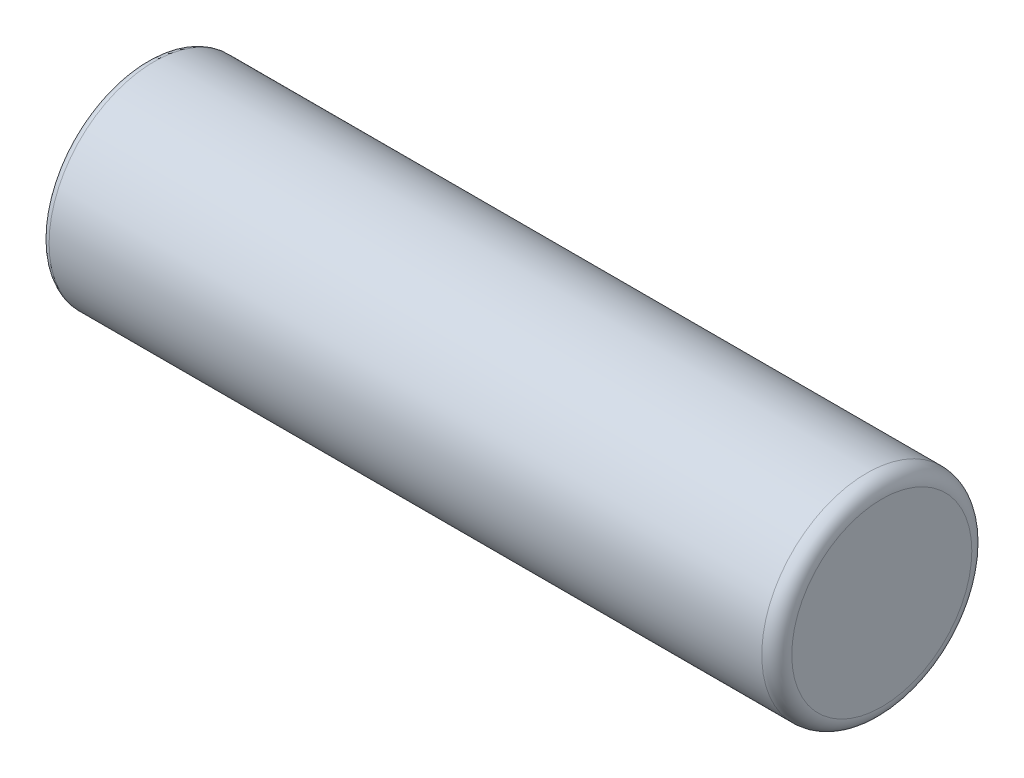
ISO-10303-21;
HEADER;
FILE_DESCRIPTION(('STEP AP214'),'2;1');
FILE_NAME('part.step','',(''),(''),'','','');
FILE_SCHEMA(('AUTOMOTIVE_DESIGN { 1 0 10303 214 1 1 1 1 }'));
ENDSEC;
DATA;
#1=APPLICATION_CONTEXT('core data for automotive mechanical design processes');
#2=APPLICATION_PROTOCOL_DEFINITION('international standard','automotive_design',2000,#1);
#3=PRODUCT_CONTEXT('',#1,'mechanical');
#4=PRODUCT('Part','Part','',(#3));
#5=PRODUCT_RELATED_PRODUCT_CATEGORY('part','',(#4));
#6=PRODUCT_DEFINITION_FORMATION('','',#4);
#7=PRODUCT_DEFINITION_CONTEXT('part definition',#1,'design');
#8=PRODUCT_DEFINITION('design','',#6,#7);
#9=PRODUCT_DEFINITION_SHAPE('','',#8);
#10=(LENGTH_UNIT() NAMED_UNIT(*) SI_UNIT(.MILLI.,.METRE.));
#11=(NAMED_UNIT(*) PLANE_ANGLE_UNIT() SI_UNIT($,.RADIAN.));
#12=(NAMED_UNIT(*) SI_UNIT($,.STERADIAN.) SOLID_ANGLE_UNIT());
#13=UNCERTAINTY_MEASURE_WITH_UNIT(LENGTH_MEASURE(1.E-05),#10,'distance_accuracy_value','');
#14=(GEOMETRIC_REPRESENTATION_CONTEXT(3) GLOBAL_UNCERTAINTY_ASSIGNED_CONTEXT((#13)) GLOBAL_UNIT_ASSIGNED_CONTEXT((#10,
#11,#12)) REPRESENTATION_CONTEXT('',''));
#15=CARTESIAN_POINT('',(0.,0.,0.));
#16=DIRECTION('',(0.,0.,1.));
#17=DIRECTION('',(1.,0.,0.));
#18=AXIS2_PLACEMENT_3D('',#15,#16,#17);
#19=CARTESIAN_POINT('',(1.99999999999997,9.,7.5));
#20=DIRECTION('',(-1.,0.,0.));
#21=DIRECTION('',(0.,0.,1.));
#22=AXIS2_PLACEMENT_3D('',#19,#20,#21);
#23=PLANE('',#22);
#24=CARTESIAN_POINT('',(1.99999999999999,8.99999999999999,7.49999999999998));
#25=DIRECTION('',(1.,0.,0.));
#26=DIRECTION('',(0.,0.,1.));
#27=AXIS2_PLACEMENT_3D('',#24,#25,#26);
#28=CIRCLE('',#27,1.99999999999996);
#29=CARTESIAN_POINT('',(1.9999999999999,9.,9.49999999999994));
#30=VERTEX_POINT('',#29);
#31=EDGE_CURVE('E99',#30,#30,#28,.T.);
#32=ORIENTED_EDGE('',*,*,#31,.F.);
#33=EDGE_LOOP('',(#32));
#34=FACE_BOUND('',#33,.T.);
#35=ADVANCED_FACE('F14',(#34),#23,.T.);
#36=CARTESIAN_POINT('',(2.50000000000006,9.,7.5));
#37=DIRECTION('',(-1.,0.,0.));
#38=DIRECTION('',(0.,0.,1.));
#39=AXIS2_PLACEMENT_3D('',#36,#37,#38);
#40=TOROIDAL_SURFACE('',#39,2.,0.500000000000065);
#41=CARTESIAN_POINT('',(2.49999999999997,9.,7.5));
#42=DIRECTION('',(1.,0.,0.));
#43=DIRECTION('',(0.,0.,-1.));
#44=AXIS2_PLACEMENT_3D('',#41,#42,#43);
#45=CIRCLE('',#44,2.5);
#46=CARTESIAN_POINT('',(2.49999999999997,9.,5.));
#47=VERTEX_POINT('',#46);
#48=EDGE_CURVE('E116',#47,#47,#45,.T.);
#49=ORIENTED_EDGE('',*,*,#48,.F.);
#50=EDGE_LOOP('',(#49));
#51=FACE_BOUND('',#50,.T.);
#52=ORIENTED_EDGE('',*,*,#31,.T.);
#53=EDGE_LOOP('',(#52));
#54=FACE_BOUND('',#53,.T.);
#55=ADVANCED_FACE('F84',(#51,#54),#40,.T.);
#56=CARTESIAN_POINT('',(2.7,9.,7.5));
#57=DIRECTION('',(1.,0.,0.));
#58=DIRECTION('',(0.,0.,-1.));
#59=AXIS2_PLACEMENT_3D('',#56,#57,#58);
#60=CYLINDRICAL_SURFACE('',#59,2.5);
#61=ORIENTED_EDGE('',*,*,#48,.T.);
#62=EDGE_LOOP('',(#61));
#63=FACE_BOUND('',#62,.T.);
#64=CARTESIAN_POINT('',(3.5,9.,7.5));
#65=DIRECTION('',(1.,0.,0.));
#66=DIRECTION('',(0.,0.,-1.));
#67=AXIS2_PLACEMENT_3D('',#64,#65,#66);
#68=CIRCLE('',#67,2.5);
#69=CARTESIAN_POINT('',(3.5,9.,5.));
#70=VERTEX_POINT('',#69);
#71=EDGE_CURVE('E18',#70,#70,#68,.T.);
#72=ORIENTED_EDGE('',*,*,#71,.F.);
#73=EDGE_LOOP('',(#72));
#74=FACE_BOUND('',#73,.T.);
#75=ADVANCED_FACE('F81',(#63,#74),#60,.T.);
#76=CARTESIAN_POINT('',(3.5,8.9794566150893,7.5));
#77=DIRECTION('',(-1.,0.,0.));
#78=DIRECTION('',(0.,0.,1.));
#79=AXIS2_PLACEMENT_3D('',#76,#77,#78);
#80=PLANE('',#79);
#81=CARTESIAN_POINT('',(3.49999999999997,9.,7.49999999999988));
#82=DIRECTION('',(1.,0.,0.));
#83=DIRECTION('',(0.,0.,1.));
#84=AXIS2_PLACEMENT_3D('',#81,#82,#83);
#85=CIRCLE('',#84,6.4999999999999);
#86=CARTESIAN_POINT('',(3.50000000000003,9.00000000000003,13.9999999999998));
#87=VERTEX_POINT('',#86);
#88=EDGE_CURVE('E65',#87,#87,#85,.T.);
#89=ORIENTED_EDGE('',*,*,#88,.F.);
#90=EDGE_LOOP('',(#89));
#91=FACE_BOUND('',#90,.T.);
#92=ORIENTED_EDGE('',*,*,#71,.T.);
#93=EDGE_LOOP('',(#92));
#94=FACE_BOUND('',#93,.T.);
#95=ADVANCED_FACE('F71',(#91,#94),#80,.T.);
#96=CARTESIAN_POINT('',(52.5,9.,7.5));
#97=DIRECTION('',(1.,0.,0.));
#98=DIRECTION('',(0.,0.,-1.));
#99=AXIS2_PLACEMENT_3D('',#96,#97,#98);
#100=PLANE('',#99);
#101=CARTESIAN_POINT('',(52.5000000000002,9.0000000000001,7.49999999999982));
#102=DIRECTION('',(-1.,0.,0.));
#103=DIRECTION('',(0.,0.,-1.));
#104=AXIS2_PLACEMENT_3D('',#101,#102,#103);
#105=CIRCLE('',#104,6.00000000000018);
#106=CARTESIAN_POINT('',(52.5000000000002,9.00000000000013,1.49999999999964));
#107=VERTEX_POINT('',#106);
#108=EDGE_CURVE('E27',#107,#107,#105,.T.);
#109=ORIENTED_EDGE('',*,*,#108,.F.);
#110=EDGE_LOOP('',(#109));
#111=FACE_BOUND('',#110,.T.);
#112=ADVANCED_FACE('F80',(#111),#100,.T.);
#113=CARTESIAN_POINT('',(3.99999999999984,9.,7.49999999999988));
#114=DIRECTION('',(-1.,0.,0.));
#115=DIRECTION('',(0.,0.,1.));
#116=AXIS2_PLACEMENT_3D('',#113,#114,#115);
#117=TOROIDAL_SURFACE('',#116,6.49999999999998,0.499999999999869);
#118=ORIENTED_EDGE('',*,*,#88,.T.);
#119=EDGE_LOOP('',(#118));
#120=FACE_BOUND('',#119,.T.);
#121=CARTESIAN_POINT('',(4.,9.,7.5));
#122=DIRECTION('',(1.,0.,0.));
#123=DIRECTION('',(0.,0.,-1.));
#124=AXIS2_PLACEMENT_3D('',#121,#122,#123);
#125=CIRCLE('',#124,7.);
#126=CARTESIAN_POINT('',(4.,9.,0.5));
#127=VERTEX_POINT('',#126);
#128=EDGE_CURVE('E22',#127,#127,#125,.T.);
#129=ORIENTED_EDGE('',*,*,#128,.F.);
#130=EDGE_LOOP('',(#129));
#131=FACE_BOUND('',#130,.T.);
#132=ADVANCED_FACE('F45',(#120,#131),#117,.T.);
#133=CARTESIAN_POINT('',(51.4999999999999,9.00000000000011,7.49999999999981));
#134=DIRECTION('',(1.,0.,0.));
#135=DIRECTION('',(0.,0.,-1.));
#136=AXIS2_PLACEMENT_3D('',#133,#134,#135);
#137=TOROIDAL_SURFACE('',#136,6.00000000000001,1.00000000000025);
#138=ORIENTED_EDGE('',*,*,#108,.T.);
#139=EDGE_LOOP('',(#138));
#140=FACE_BOUND('',#139,.T.);
#141=CARTESIAN_POINT('',(51.5,9.,7.5));
#142=DIRECTION('',(1.,0.,0.));
#143=DIRECTION('',(0.,0.,-1.));
#144=AXIS2_PLACEMENT_3D('',#141,#142,#143);
#145=CIRCLE('',#144,7.);
#146=CARTESIAN_POINT('',(51.5,9.,0.5));
#147=VERTEX_POINT('',#146);
#148=EDGE_CURVE('E10',#147,#147,#145,.F.);
#149=ORIENTED_EDGE('',*,*,#148,.F.);
#150=EDGE_LOOP('',(#149));
#151=FACE_BOUND('',#150,.T.);
#152=ADVANCED_FACE('F39',(#140,#151),#137,.T.);
#153=CARTESIAN_POINT('',(13.5,9.,7.5));
#154=DIRECTION('',(1.,0.,0.));
#155=DIRECTION('',(0.,0.,-1.));
#156=AXIS2_PLACEMENT_3D('',#153,#154,#155);
#157=CYLINDRICAL_SURFACE('',#156,7.);
#158=ORIENTED_EDGE('',*,*,#148,.T.);
#159=EDGE_LOOP('',(#158));
#160=FACE_BOUND('',#159,.T.);
#161=ORIENTED_EDGE('',*,*,#128,.T.);
#162=EDGE_LOOP('',(#161));
#163=FACE_BOUND('',#162,.T.);
#164=ADVANCED_FACE('F44',(#160,#163),#157,.T.);
#165=CLOSED_SHELL('',(#35,#55,#75,#95,#112,#132,#152,#164));
#166=MANIFOLD_SOLID_BREP('B1',#165);
#167=ADVANCED_BREP_SHAPE_REPRESENTATION('',(#18,#166),#14);
#168=SHAPE_DEFINITION_REPRESENTATION(#9,#167);
ENDSEC;
END-ISO-10303-21;
